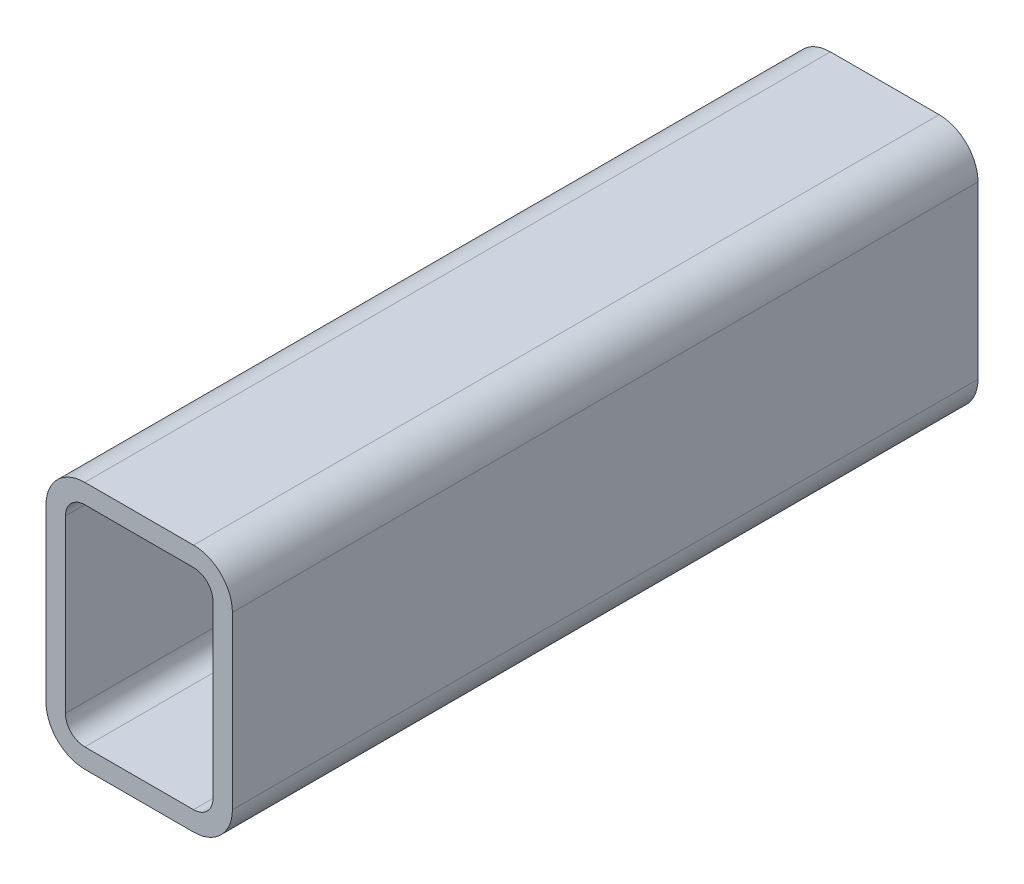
ISO-10303-21;
HEADER;
FILE_DESCRIPTION(('STEP AP214'),'2;1');
FILE_NAME('part.step','',(''),(''),'','','');
FILE_SCHEMA(('AUTOMOTIVE_DESIGN { 1 0 10303 214 1 1 1 1 }'));
ENDSEC;
DATA;
#1=APPLICATION_CONTEXT('core data for automotive mechanical design processes');
#2=APPLICATION_PROTOCOL_DEFINITION('international standard','automotive_design',2000,#1);
#3=PRODUCT_CONTEXT('',#1,'mechanical');
#4=PRODUCT('Part','Part','',(#3));
#5=PRODUCT_RELATED_PRODUCT_CATEGORY('part','',(#4));
#6=PRODUCT_DEFINITION_FORMATION('','',#4);
#7=PRODUCT_DEFINITION_CONTEXT('part definition',#1,'design');
#8=PRODUCT_DEFINITION('design','',#6,#7);
#9=PRODUCT_DEFINITION_SHAPE('','',#8);
#10=(LENGTH_UNIT() NAMED_UNIT(*) SI_UNIT(.MILLI.,.METRE.));
#11=(NAMED_UNIT(*) PLANE_ANGLE_UNIT() SI_UNIT($,.RADIAN.));
#12=(NAMED_UNIT(*) SI_UNIT($,.STERADIAN.) SOLID_ANGLE_UNIT());
#13=UNCERTAINTY_MEASURE_WITH_UNIT(LENGTH_MEASURE(1.E-05),#10,'distance_accuracy_value','');
#14=(GEOMETRIC_REPRESENTATION_CONTEXT(3) GLOBAL_UNCERTAINTY_ASSIGNED_CONTEXT((#13)) GLOBAL_UNIT_ASSIGNED_CONTEXT((#10,
#11,#12)) REPRESENTATION_CONTEXT('',''));
#15=CARTESIAN_POINT('',(0.,0.,0.));
#16=DIRECTION('',(0.,0.,1.));
#17=DIRECTION('',(1.,0.,0.));
#18=AXIS2_PLACEMENT_3D('',#15,#16,#17);
#19=CARTESIAN_POINT('',(18.3641160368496,87.7827651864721,304.8));
#20=DIRECTION('',(0.,0.,1.));
#21=DIRECTION('',(1.,0.,0.));
#22=AXIS2_PLACEMENT_3D('',#19,#20,#21);
#23=PLANE('',#22);
#24=CARTESIAN_POINT('',(18.3641160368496,87.7827651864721,304.8));
#25=DIRECTION('',(0.,0.,1.));
#26=DIRECTION('',(1.,0.,0.));
#27=AXIS2_PLACEMENT_3D('',#24,#25,#26);
#28=CIRCLE('',#27,15.875);
#29=CARTESIAN_POINT('',(18.3641160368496,103.657765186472,304.8));
#30=VERTEX_POINT('',#29);
#31=CARTESIAN_POINT('',(2.48911603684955,87.7827651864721,304.8));
#32=VERTEX_POINT('',#31);
#33=EDGE_CURVE('E213',#30,#32,#28,.T.);
#34=ORIENTED_EDGE('',*,*,#33,.T.);
#35=DIRECTION('',(0.,-1.,0.));
#36=VECTOR('',#35,1.);
#37=CARTESIAN_POINT('',(2.48911603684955,17.9327651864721,304.8));
#38=LINE('',#37,#36);
#39=CARTESIAN_POINT('',(2.48911603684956,17.9327651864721,304.8));
#40=VERTEX_POINT('',#39);
#41=EDGE_CURVE('E216',#32,#40,#38,.T.);
#42=ORIENTED_EDGE('',*,*,#41,.T.);
#43=CARTESIAN_POINT('',(18.3641160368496,17.9327651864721,304.8));
#44=DIRECTION('',(0.,0.,1.));
#45=DIRECTION('',(1.,0.,0.));
#46=AXIS2_PLACEMENT_3D('',#43,#44,#45);
#47=CIRCLE('',#46,15.875);
#48=CARTESIAN_POINT('',(18.3641160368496,2.05776518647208,304.8));
#49=VERTEX_POINT('',#48);
#50=EDGE_CURVE('E219',#40,#49,#47,.T.);
#51=ORIENTED_EDGE('',*,*,#50,.T.);
#52=DIRECTION('',(1.,0.,0.));
#53=VECTOR('',#52,1.);
#54=CARTESIAN_POINT('',(62.8141160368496,2.05776518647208,304.8));
#55=LINE('',#54,#53);
#56=CARTESIAN_POINT('',(62.8141160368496,2.05776518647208,304.8));
#57=VERTEX_POINT('',#56);
#58=EDGE_CURVE('E221',#49,#57,#55,.T.);
#59=ORIENTED_EDGE('',*,*,#58,.T.);
#60=CARTESIAN_POINT('',(62.8141160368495,17.9327651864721,304.8));
#61=DIRECTION('',(0.,0.,1.));
#62=DIRECTION('',(1.,0.,0.));
#63=AXIS2_PLACEMENT_3D('',#60,#61,#62);
#64=CIRCLE('',#63,15.875);
#65=CARTESIAN_POINT('',(78.6891160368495,17.9327651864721,304.8));
#66=VERTEX_POINT('',#65);
#67=EDGE_CURVE('E223',#57,#66,#64,.T.);
#68=ORIENTED_EDGE('',*,*,#67,.T.);
#69=DIRECTION('',(0.,1.,0.));
#70=VECTOR('',#69,1.);
#71=CARTESIAN_POINT('',(78.6891160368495,87.7827651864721,304.8));
#72=LINE('',#71,#70);
#73=CARTESIAN_POINT('',(78.6891160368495,87.7827651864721,304.8));
#74=VERTEX_POINT('',#73);
#75=EDGE_CURVE('E225',#66,#74,#72,.T.);
#76=ORIENTED_EDGE('',*,*,#75,.T.);
#77=CARTESIAN_POINT('',(62.8141160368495,87.7827651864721,304.8));
#78=DIRECTION('',(0.,0.,1.));
#79=DIRECTION('',(1.,0.,0.));
#80=AXIS2_PLACEMENT_3D('',#77,#78,#79);
#81=CIRCLE('',#80,15.875);
#82=CARTESIAN_POINT('',(62.8141160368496,103.657765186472,304.8));
#83=VERTEX_POINT('',#82);
#84=EDGE_CURVE('E227',#74,#83,#81,.T.);
#85=ORIENTED_EDGE('',*,*,#84,.T.);
#86=DIRECTION('',(-1.,0.,0.));
#87=VECTOR('',#86,1.);
#88=CARTESIAN_POINT('',(18.3641160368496,103.657765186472,304.8));
#89=LINE('',#88,#87);
#90=EDGE_CURVE('E229',#83,#30,#89,.T.);
#91=ORIENTED_EDGE('',*,*,#90,.T.);
#92=EDGE_LOOP('',(#34,#42,#51,#59,#68,#76,#85,#91));
#93=FACE_BOUND('',#92,.T.);
#94=DIRECTION('',(0.,-1.,0.));
#95=VECTOR('',#94,1.);
#96=CARTESIAN_POINT('',(10.4266160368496,17.9327651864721,304.8));
#97=LINE('',#96,#95);
#98=CARTESIAN_POINT('',(10.4266160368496,87.7827651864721,304.8));
#99=VERTEX_POINT('',#98);
#100=CARTESIAN_POINT('',(10.4266160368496,17.9327651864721,304.8));
#101=VERTEX_POINT('',#100);
#102=EDGE_CURVE('E156',#99,#101,#97,.T.);
#103=ORIENTED_EDGE('',*,*,#102,.F.);
#104=CARTESIAN_POINT('',(18.3641160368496,87.7827651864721,304.8));
#105=DIRECTION('',(0.,0.,1.));
#106=DIRECTION('',(1.,0.,0.));
#107=AXIS2_PLACEMENT_3D('',#104,#105,#106);
#108=CIRCLE('',#107,7.93750000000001);
#109=CARTESIAN_POINT('',(18.3641160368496,95.7202651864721,304.8));
#110=VERTEX_POINT('',#109);
#111=EDGE_CURVE('E148',#110,#99,#108,.T.);
#112=ORIENTED_EDGE('',*,*,#111,.F.);
#113=DIRECTION('',(-1.,0.,0.));
#114=VECTOR('',#113,1.);
#115=CARTESIAN_POINT('',(18.3641160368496,95.7202651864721,304.8));
#116=LINE('',#115,#114);
#117=CARTESIAN_POINT('',(62.8141160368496,95.7202651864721,304.8));
#118=VERTEX_POINT('',#117);
#119=EDGE_CURVE('E181',#118,#110,#116,.T.);
#120=ORIENTED_EDGE('',*,*,#119,.F.);
#121=CARTESIAN_POINT('',(62.8141160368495,87.7827651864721,304.8));
#122=DIRECTION('',(0.,0.,1.));
#123=DIRECTION('',(1.,0.,0.));
#124=AXIS2_PLACEMENT_3D('',#121,#122,#123);
#125=CIRCLE('',#124,7.9375);
#126=CARTESIAN_POINT('',(70.7516160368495,87.7827651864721,304.8));
#127=VERTEX_POINT('',#126);
#128=EDGE_CURVE('E179',#127,#118,#125,.T.);
#129=ORIENTED_EDGE('',*,*,#128,.F.);
#130=DIRECTION('',(0.,1.,0.));
#131=VECTOR('',#130,1.);
#132=CARTESIAN_POINT('',(70.7516160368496,87.7827651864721,304.8));
#133=LINE('',#132,#131);
#134=CARTESIAN_POINT('',(70.7516160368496,17.9327651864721,304.8));
#135=VERTEX_POINT('',#134);
#136=EDGE_CURVE('E177',#135,#127,#133,.T.);
#137=ORIENTED_EDGE('',*,*,#136,.F.);
#138=CARTESIAN_POINT('',(62.8141160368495,17.9327651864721,304.8));
#139=DIRECTION('',(0.,0.,1.));
#140=DIRECTION('',(1.,0.,0.));
#141=AXIS2_PLACEMENT_3D('',#138,#139,#140);
#142=CIRCLE('',#141,7.9375);
#143=CARTESIAN_POINT('',(62.8141160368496,9.99526518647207,304.8));
#144=VERTEX_POINT('',#143);
#145=EDGE_CURVE('E175',#144,#135,#142,.T.);
#146=ORIENTED_EDGE('',*,*,#145,.F.);
#147=DIRECTION('',(1.,0.,0.));
#148=VECTOR('',#147,1.);
#149=CARTESIAN_POINT('',(62.8141160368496,9.99526518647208,304.8));
#150=LINE('',#149,#148);
#151=CARTESIAN_POINT('',(18.3641160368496,9.99526518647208,304.8));
#152=VERTEX_POINT('',#151);
#153=EDGE_CURVE('E171',#152,#144,#150,.T.);
#154=ORIENTED_EDGE('',*,*,#153,.F.);
#155=CARTESIAN_POINT('',(18.3641160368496,17.9327651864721,304.8));
#156=DIRECTION('',(0.,0.,1.));
#157=DIRECTION('',(1.,0.,0.));
#158=AXIS2_PLACEMENT_3D('',#155,#156,#157);
#159=CIRCLE('',#158,7.9375);
#160=EDGE_CURVE('E169',#101,#152,#159,.T.);
#161=ORIENTED_EDGE('',*,*,#160,.F.);
#162=EDGE_LOOP('',(#103,#112,#120,#129,#137,#146,#154,#161));
#163=FACE_BOUND('',#162,.T.);
#164=ADVANCED_FACE('F35',(#93,#163),#23,.T.);
#165=CARTESIAN_POINT('',(18.3641160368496,87.7827651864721,0.));
#166=DIRECTION('',(0.,0.,1.));
#167=DIRECTION('',(1.,0.,0.));
#168=AXIS2_PLACEMENT_3D('',#165,#166,#167);
#169=PLANE('',#168);
#170=CARTESIAN_POINT('',(18.3641160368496,87.7827651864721,0.));
#171=DIRECTION('',(0.,0.,1.));
#172=DIRECTION('',(1.,0.,0.));
#173=AXIS2_PLACEMENT_3D('',#170,#171,#172);
#174=CIRCLE('',#173,15.875);
#175=CARTESIAN_POINT('',(18.3641160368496,103.657765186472,0.));
#176=VERTEX_POINT('',#175);
#177=CARTESIAN_POINT('',(2.48911603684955,87.7827651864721,0.));
#178=VERTEX_POINT('',#177);
#179=EDGE_CURVE('E164',#176,#178,#174,.T.);
#180=ORIENTED_EDGE('',*,*,#179,.F.);
#181=DIRECTION('',(-1.,0.,0.));
#182=VECTOR('',#181,1.);
#183=CARTESIAN_POINT('',(18.3641160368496,103.657765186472,0.));
#184=LINE('',#183,#182);
#185=CARTESIAN_POINT('',(62.8141160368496,103.657765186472,0.));
#186=VERTEX_POINT('',#185);
#187=EDGE_CURVE('E217',#186,#176,#184,.T.);
#188=ORIENTED_EDGE('',*,*,#187,.F.);
#189=CARTESIAN_POINT('',(62.8141160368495,87.7827651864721,0.));
#190=DIRECTION('',(0.,0.,1.));
#191=DIRECTION('',(1.,0.,0.));
#192=AXIS2_PLACEMENT_3D('',#189,#190,#191);
#193=CIRCLE('',#192,15.875);
#194=CARTESIAN_POINT('',(78.6891160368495,87.7827651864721,0.));
#195=VERTEX_POINT('',#194);
#196=EDGE_CURVE('E244',#195,#186,#193,.T.);
#197=ORIENTED_EDGE('',*,*,#196,.F.);
#198=DIRECTION('',(0.,1.,0.));
#199=VECTOR('',#198,1.);
#200=CARTESIAN_POINT('',(78.6891160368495,87.7827651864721,0.));
#201=LINE('',#200,#199);
#202=CARTESIAN_POINT('',(78.6891160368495,17.9327651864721,0.));
#203=VERTEX_POINT('',#202);
#204=EDGE_CURVE('E242',#203,#195,#201,.T.);
#205=ORIENTED_EDGE('',*,*,#204,.F.);
#206=CARTESIAN_POINT('',(62.8141160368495,17.9327651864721,0.));
#207=DIRECTION('',(0.,0.,1.));
#208=DIRECTION('',(1.,0.,0.));
#209=AXIS2_PLACEMENT_3D('',#206,#207,#208);
#210=CIRCLE('',#209,15.875);
#211=CARTESIAN_POINT('',(62.8141160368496,2.05776518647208,0.));
#212=VERTEX_POINT('',#211);
#213=EDGE_CURVE('E240',#212,#203,#210,.T.);
#214=ORIENTED_EDGE('',*,*,#213,.F.);
#215=DIRECTION('',(1.,0.,0.));
#216=VECTOR('',#215,1.);
#217=CARTESIAN_POINT('',(62.8141160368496,2.05776518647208,0.));
#218=LINE('',#217,#216);
#219=CARTESIAN_POINT('',(18.3641160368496,2.05776518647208,0.));
#220=VERTEX_POINT('',#219);
#221=EDGE_CURVE('E238',#220,#212,#218,.T.);
#222=ORIENTED_EDGE('',*,*,#221,.F.);
#223=CARTESIAN_POINT('',(18.3641160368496,17.9327651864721,0.));
#224=DIRECTION('',(0.,0.,1.));
#225=DIRECTION('',(1.,0.,0.));
#226=AXIS2_PLACEMENT_3D('',#223,#224,#225);
#227=CIRCLE('',#226,15.875);
#228=CARTESIAN_POINT('',(2.48911603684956,17.9327651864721,0.));
#229=VERTEX_POINT('',#228);
#230=EDGE_CURVE('E236',#229,#220,#227,.T.);
#231=ORIENTED_EDGE('',*,*,#230,.F.);
#232=DIRECTION('',(0.,-1.,0.));
#233=VECTOR('',#232,1.);
#234=CARTESIAN_POINT('',(2.48911603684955,17.9327651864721,0.));
#235=LINE('',#234,#233);
#236=EDGE_CURVE('E234',#178,#229,#235,.T.);
#237=ORIENTED_EDGE('',*,*,#236,.F.);
#238=EDGE_LOOP('',(#180,#188,#197,#205,#214,#222,#231,#237));
#239=FACE_BOUND('',#238,.T.);
#240=CARTESIAN_POINT('',(18.3641160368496,87.7827651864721,0.));
#241=DIRECTION('',(0.,0.,1.));
#242=DIRECTION('',(1.,0.,0.));
#243=AXIS2_PLACEMENT_3D('',#240,#241,#242);
#244=CIRCLE('',#243,7.93750000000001);
#245=CARTESIAN_POINT('',(18.3641160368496,95.7202651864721,0.));
#246=VERTEX_POINT('',#245);
#247=CARTESIAN_POINT('',(10.4266160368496,87.7827651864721,0.));
#248=VERTEX_POINT('',#247);
#249=EDGE_CURVE('E58',#246,#248,#244,.T.);
#250=ORIENTED_EDGE('',*,*,#249,.T.);
#251=DIRECTION('',(0.,-1.,0.));
#252=VECTOR('',#251,1.);
#253=CARTESIAN_POINT('',(10.4266160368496,17.9327651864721,0.));
#254=LINE('',#253,#252);
#255=CARTESIAN_POINT('',(10.4266160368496,17.9327651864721,0.));
#256=VERTEX_POINT('',#255);
#257=EDGE_CURVE('E163',#248,#256,#254,.T.);
#258=ORIENTED_EDGE('',*,*,#257,.T.);
#259=CARTESIAN_POINT('',(18.3641160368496,17.9327651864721,0.));
#260=DIRECTION('',(0.,0.,1.));
#261=DIRECTION('',(1.,0.,0.));
#262=AXIS2_PLACEMENT_3D('',#259,#260,#261);
#263=CIRCLE('',#262,7.9375);
#264=CARTESIAN_POINT('',(18.3641160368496,9.99526518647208,0.));
#265=VERTEX_POINT('',#264);
#266=EDGE_CURVE('E185',#256,#265,#263,.T.);
#267=ORIENTED_EDGE('',*,*,#266,.T.);
#268=DIRECTION('',(1.,0.,0.));
#269=VECTOR('',#268,1.);
#270=CARTESIAN_POINT('',(62.8141160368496,9.99526518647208,0.));
#271=LINE('',#270,#269);
#272=CARTESIAN_POINT('',(62.8141160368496,9.99526518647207,0.));
#273=VERTEX_POINT('',#272);
#274=EDGE_CURVE('E188',#265,#273,#271,.T.);
#275=ORIENTED_EDGE('',*,*,#274,.T.);
#276=CARTESIAN_POINT('',(62.8141160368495,17.9327651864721,0.));
#277=DIRECTION('',(0.,0.,1.));
#278=DIRECTION('',(1.,0.,0.));
#279=AXIS2_PLACEMENT_3D('',#276,#277,#278);
#280=CIRCLE('',#279,7.9375);
#281=CARTESIAN_POINT('',(70.7516160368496,17.9327651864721,0.));
#282=VERTEX_POINT('',#281);
#283=EDGE_CURVE('E191',#273,#282,#280,.T.);
#284=ORIENTED_EDGE('',*,*,#283,.T.);
#285=DIRECTION('',(0.,1.,0.));
#286=VECTOR('',#285,1.);
#287=CARTESIAN_POINT('',(70.7516160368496,87.7827651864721,0.));
#288=LINE('',#287,#286);
#289=CARTESIAN_POINT('',(70.7516160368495,87.7827651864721,0.));
#290=VERTEX_POINT('',#289);
#291=EDGE_CURVE('E194',#282,#290,#288,.T.);
#292=ORIENTED_EDGE('',*,*,#291,.T.);
#293=CARTESIAN_POINT('',(62.8141160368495,87.7827651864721,0.));
#294=DIRECTION('',(0.,0.,1.));
#295=DIRECTION('',(1.,0.,0.));
#296=AXIS2_PLACEMENT_3D('',#293,#294,#295);
#297=CIRCLE('',#296,7.9375);
#298=CARTESIAN_POINT('',(62.8141160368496,95.7202651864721,0.));
#299=VERTEX_POINT('',#298);
#300=EDGE_CURVE('E197',#290,#299,#297,.T.);
#301=ORIENTED_EDGE('',*,*,#300,.T.);
#302=DIRECTION('',(-1.,0.,0.));
#303=VECTOR('',#302,1.);
#304=CARTESIAN_POINT('',(18.3641160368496,95.7202651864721,0.));
#305=LINE('',#304,#303);
#306=EDGE_CURVE('E157',#299,#246,#305,.T.);
#307=ORIENTED_EDGE('',*,*,#306,.T.);
#308=EDGE_LOOP('',(#250,#258,#267,#275,#284,#292,#301,#307));
#309=FACE_BOUND('',#308,.T.);
#310=ADVANCED_FACE('F274',(#239,#309),#169,.F.);
#311=CARTESIAN_POINT('',(18.3641160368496,87.7827651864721,304.8));
#312=DIRECTION('',(0.,0.,-1.));
#313=DIRECTION('',(-1.,0.,0.));
#314=AXIS2_PLACEMENT_3D('',#311,#312,#313);
#315=CYLINDRICAL_SURFACE('',#314,15.875);
#316=ORIENTED_EDGE('',*,*,#179,.T.);
#317=DIRECTION('',(0.,0.,-1.));
#318=VECTOR('',#317,1.);
#319=CARTESIAN_POINT('',(2.48911603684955,87.7827651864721,304.8));
#320=LINE('',#319,#318);
#321=EDGE_CURVE('E11',#32,#178,#320,.T.);
#322=ORIENTED_EDGE('',*,*,#321,.F.);
#323=ORIENTED_EDGE('',*,*,#33,.F.);
#324=DIRECTION('',(0.,0.,-1.));
#325=VECTOR('',#324,1.);
#326=CARTESIAN_POINT('',(18.3641160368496,103.657765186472,304.8));
#327=LINE('',#326,#325);
#328=EDGE_CURVE('E231',#30,#176,#327,.T.);
#329=ORIENTED_EDGE('',*,*,#328,.T.);
#330=EDGE_LOOP('',(#316,#322,#323,#329));
#331=FACE_BOUND('',#330,.T.);
#332=ADVANCED_FACE('F37',(#331),#315,.T.);
#333=CARTESIAN_POINT('',(2.48911603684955,17.9327651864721,304.8));
#334=DIRECTION('',(1.,0.,0.));
#335=DIRECTION('',(0.,0.,-1.));
#336=AXIS2_PLACEMENT_3D('',#333,#334,#335);
#337=PLANE('',#336);
#338=ORIENTED_EDGE('',*,*,#236,.T.);
#339=DIRECTION('',(0.,0.,-1.));
#340=VECTOR('',#339,1.);
#341=CARTESIAN_POINT('',(2.48911603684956,17.9327651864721,304.8));
#342=LINE('',#341,#340);
#343=EDGE_CURVE('E43',#40,#229,#342,.T.);
#344=ORIENTED_EDGE('',*,*,#343,.F.);
#345=ORIENTED_EDGE('',*,*,#41,.F.);
#346=ORIENTED_EDGE('',*,*,#321,.T.);
#347=EDGE_LOOP('',(#338,#344,#345,#346));
#348=FACE_BOUND('',#347,.T.);
#349=ADVANCED_FACE('F291',(#348),#337,.F.);
#350=CARTESIAN_POINT('',(18.3641160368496,17.9327651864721,304.8));
#351=DIRECTION('',(0.,0.,-1.));
#352=DIRECTION('',(-1.,0.,0.));
#353=AXIS2_PLACEMENT_3D('',#350,#351,#352);
#354=CYLINDRICAL_SURFACE('',#353,15.875);
#355=ORIENTED_EDGE('',*,*,#230,.T.);
#356=DIRECTION('',(0.,0.,-1.));
#357=VECTOR('',#356,1.);
#358=CARTESIAN_POINT('',(18.3641160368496,2.05776518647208,304.8));
#359=LINE('',#358,#357);
#360=EDGE_CURVE('E261',#49,#220,#359,.T.);
#361=ORIENTED_EDGE('',*,*,#360,.F.);
#362=ORIENTED_EDGE('',*,*,#50,.F.);
#363=ORIENTED_EDGE('',*,*,#343,.T.);
#364=EDGE_LOOP('',(#355,#361,#362,#363));
#365=FACE_BOUND('',#364,.T.);
#366=ADVANCED_FACE('F268',(#365),#354,.T.);
#367=CARTESIAN_POINT('',(62.8141160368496,2.05776518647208,304.8));
#368=DIRECTION('',(0.,1.,0.));
#369=DIRECTION('',(0.,0.,1.));
#370=AXIS2_PLACEMENT_3D('',#367,#368,#369);
#371=PLANE('',#370);
#372=ORIENTED_EDGE('',*,*,#221,.T.);
#373=DIRECTION('',(0.,0.,-1.));
#374=VECTOR('',#373,1.);
#375=CARTESIAN_POINT('',(62.8141160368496,2.05776518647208,304.8));
#376=LINE('',#375,#374);
#377=EDGE_CURVE('E258',#57,#212,#376,.T.);
#378=ORIENTED_EDGE('',*,*,#377,.F.);
#379=ORIENTED_EDGE('',*,*,#58,.F.);
#380=ORIENTED_EDGE('',*,*,#360,.T.);
#381=EDGE_LOOP('',(#372,#378,#379,#380));
#382=FACE_BOUND('',#381,.T.);
#383=ADVANCED_FACE('F280',(#382),#371,.F.);
#384=CARTESIAN_POINT('',(62.8141160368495,17.9327651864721,304.8));
#385=DIRECTION('',(0.,0.,-1.));
#386=DIRECTION('',(-1.,0.,0.));
#387=AXIS2_PLACEMENT_3D('',#384,#385,#386);
#388=CYLINDRICAL_SURFACE('',#387,15.875);
#389=ORIENTED_EDGE('',*,*,#213,.T.);
#390=DIRECTION('',(0.,0.,-1.));
#391=VECTOR('',#390,1.);
#392=CARTESIAN_POINT('',(78.6891160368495,17.9327651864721,304.8));
#393=LINE('',#392,#391);
#394=EDGE_CURVE('E255',#66,#203,#393,.T.);
#395=ORIENTED_EDGE('',*,*,#394,.F.);
#396=ORIENTED_EDGE('',*,*,#67,.F.);
#397=ORIENTED_EDGE('',*,*,#377,.T.);
#398=EDGE_LOOP('',(#389,#395,#396,#397));
#399=FACE_BOUND('',#398,.T.);
#400=ADVANCED_FACE('F284',(#399),#388,.T.);
#401=CARTESIAN_POINT('',(78.6891160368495,87.7827651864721,304.8));
#402=DIRECTION('',(-1.,0.,0.));
#403=DIRECTION('',(0.,0.,1.));
#404=AXIS2_PLACEMENT_3D('',#401,#402,#403);
#405=PLANE('',#404);
#406=ORIENTED_EDGE('',*,*,#204,.T.);
#407=DIRECTION('',(0.,0.,-1.));
#408=VECTOR('',#407,1.);
#409=CARTESIAN_POINT('',(78.6891160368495,87.7827651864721,304.8));
#410=LINE('',#409,#408);
#411=EDGE_CURVE('E252',#74,#195,#410,.T.);
#412=ORIENTED_EDGE('',*,*,#411,.F.);
#413=ORIENTED_EDGE('',*,*,#75,.F.);
#414=ORIENTED_EDGE('',*,*,#394,.T.);
#415=EDGE_LOOP('',(#406,#412,#413,#414));
#416=FACE_BOUND('',#415,.T.);
#417=ADVANCED_FACE('F304',(#416),#405,.F.);
#418=CARTESIAN_POINT('',(62.8141160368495,87.7827651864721,304.8));
#419=DIRECTION('',(0.,0.,-1.));
#420=DIRECTION('',(-1.,0.,0.));
#421=AXIS2_PLACEMENT_3D('',#418,#419,#420);
#422=CYLINDRICAL_SURFACE('',#421,15.875);
#423=ORIENTED_EDGE('',*,*,#196,.T.);
#424=DIRECTION('',(0.,0.,-1.));
#425=VECTOR('',#424,1.);
#426=CARTESIAN_POINT('',(62.8141160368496,103.657765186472,304.8));
#427=LINE('',#426,#425);
#428=EDGE_CURVE('E249',#83,#186,#427,.T.);
#429=ORIENTED_EDGE('',*,*,#428,.F.);
#430=ORIENTED_EDGE('',*,*,#84,.F.);
#431=ORIENTED_EDGE('',*,*,#411,.T.);
#432=EDGE_LOOP('',(#423,#429,#430,#431));
#433=FACE_BOUND('',#432,.T.);
#434=ADVANCED_FACE('F302',(#433),#422,.T.);
#435=CARTESIAN_POINT('',(18.3641160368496,103.657765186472,304.8));
#436=DIRECTION('',(0.,-1.,0.));
#437=DIRECTION('',(0.,0.,-1.));
#438=AXIS2_PLACEMENT_3D('',#435,#436,#437);
#439=PLANE('',#438);
#440=ORIENTED_EDGE('',*,*,#187,.T.);
#441=ORIENTED_EDGE('',*,*,#328,.F.);
#442=ORIENTED_EDGE('',*,*,#90,.F.);
#443=ORIENTED_EDGE('',*,*,#428,.T.);
#444=EDGE_LOOP('',(#440,#441,#442,#443));
#445=FACE_BOUND('',#444,.T.);
#446=ADVANCED_FACE('F297',(#445),#439,.F.);
#447=CARTESIAN_POINT('',(18.3641160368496,87.7827651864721,304.8));
#448=DIRECTION('',(0.,0.,-1.));
#449=DIRECTION('',(-1.,0.,0.));
#450=AXIS2_PLACEMENT_3D('',#447,#448,#449);
#451=CYLINDRICAL_SURFACE('',#450,7.93750000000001);
#452=ORIENTED_EDGE('',*,*,#249,.F.);
#453=DIRECTION('',(0.,0.,-1.));
#454=VECTOR('',#453,1.);
#455=CARTESIAN_POINT('',(18.3641160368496,95.7202651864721,304.8));
#456=LINE('',#455,#454);
#457=EDGE_CURVE('E152',#110,#246,#456,.T.);
#458=ORIENTED_EDGE('',*,*,#457,.F.);
#459=ORIENTED_EDGE('',*,*,#111,.T.);
#460=DIRECTION('',(0.,0.,-1.));
#461=VECTOR('',#460,1.);
#462=CARTESIAN_POINT('',(10.4266160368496,87.7827651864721,304.8));
#463=LINE('',#462,#461);
#464=EDGE_CURVE('E151',#99,#248,#463,.T.);
#465=ORIENTED_EDGE('',*,*,#464,.T.);
#466=EDGE_LOOP('',(#452,#458,#459,#465));
#467=FACE_BOUND('',#466,.T.);
#468=ADVANCED_FACE('F150',(#467),#451,.F.);
#469=CARTESIAN_POINT('',(10.4266160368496,17.9327651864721,304.8));
#470=DIRECTION('',(1.,0.,0.));
#471=DIRECTION('',(0.,0.,-1.));
#472=AXIS2_PLACEMENT_3D('',#469,#470,#471);
#473=PLANE('',#472);
#474=ORIENTED_EDGE('',*,*,#257,.F.);
#475=ORIENTED_EDGE('',*,*,#464,.F.);
#476=ORIENTED_EDGE('',*,*,#102,.T.);
#477=DIRECTION('',(0.,0.,-1.));
#478=VECTOR('',#477,1.);
#479=CARTESIAN_POINT('',(10.4266160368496,17.9327651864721,304.8));
#480=LINE('',#479,#478);
#481=EDGE_CURVE('E165',#101,#256,#480,.T.);
#482=ORIENTED_EDGE('',*,*,#481,.T.);
#483=EDGE_LOOP('',(#474,#475,#476,#482));
#484=FACE_BOUND('',#483,.T.);
#485=ADVANCED_FACE('F160',(#484),#473,.T.);
#486=CARTESIAN_POINT('',(18.3641160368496,17.9327651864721,304.8));
#487=DIRECTION('',(0.,0.,-1.));
#488=DIRECTION('',(-1.,0.,0.));
#489=AXIS2_PLACEMENT_3D('',#486,#487,#488);
#490=CYLINDRICAL_SURFACE('',#489,7.9375);
#491=ORIENTED_EDGE('',*,*,#266,.F.);
#492=ORIENTED_EDGE('',*,*,#481,.F.);
#493=ORIENTED_EDGE('',*,*,#160,.T.);
#494=DIRECTION('',(0.,0.,-1.));
#495=VECTOR('',#494,1.);
#496=CARTESIAN_POINT('',(18.3641160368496,9.99526518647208,304.8));
#497=LINE('',#496,#495);
#498=EDGE_CURVE('E210',#152,#265,#497,.T.);
#499=ORIENTED_EDGE('',*,*,#498,.T.);
#500=EDGE_LOOP('',(#491,#492,#493,#499));
#501=FACE_BOUND('',#500,.T.);
#502=ADVANCED_FACE('F329',(#501),#490,.F.);
#503=CARTESIAN_POINT('',(62.8141160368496,9.99526518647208,304.8));
#504=DIRECTION('',(0.,1.,0.));
#505=DIRECTION('',(0.,0.,1.));
#506=AXIS2_PLACEMENT_3D('',#503,#504,#505);
#507=PLANE('',#506);
#508=ORIENTED_EDGE('',*,*,#274,.F.);
#509=ORIENTED_EDGE('',*,*,#498,.F.);
#510=ORIENTED_EDGE('',*,*,#153,.T.);
#511=DIRECTION('',(0.,0.,-1.));
#512=VECTOR('',#511,1.);
#513=CARTESIAN_POINT('',(62.8141160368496,9.99526518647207,304.8));
#514=LINE('',#513,#512);
#515=EDGE_CURVE('E208',#144,#273,#514,.T.);
#516=ORIENTED_EDGE('',*,*,#515,.T.);
#517=EDGE_LOOP('',(#508,#509,#510,#516));
#518=FACE_BOUND('',#517,.T.);
#519=ADVANCED_FACE('F333',(#518),#507,.T.);
#520=CARTESIAN_POINT('',(62.8141160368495,17.9327651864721,304.8));
#521=DIRECTION('',(0.,0.,-1.));
#522=DIRECTION('',(-1.,0.,0.));
#523=AXIS2_PLACEMENT_3D('',#520,#521,#522);
#524=CYLINDRICAL_SURFACE('',#523,7.9375);
#525=ORIENTED_EDGE('',*,*,#283,.F.);
#526=ORIENTED_EDGE('',*,*,#515,.F.);
#527=ORIENTED_EDGE('',*,*,#145,.T.);
#528=DIRECTION('',(0.,0.,-1.));
#529=VECTOR('',#528,1.);
#530=CARTESIAN_POINT('',(70.7516160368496,17.9327651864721,304.8));
#531=LINE('',#530,#529);
#532=EDGE_CURVE('E206',#135,#282,#531,.T.);
#533=ORIENTED_EDGE('',*,*,#532,.T.);
#534=EDGE_LOOP('',(#525,#526,#527,#533));
#535=FACE_BOUND('',#534,.T.);
#536=ADVANCED_FACE('F339',(#535),#524,.F.);
#537=CARTESIAN_POINT('',(70.7516160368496,87.7827651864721,304.8));
#538=DIRECTION('',(-1.,0.,0.));
#539=DIRECTION('',(0.,0.,1.));
#540=AXIS2_PLACEMENT_3D('',#537,#538,#539);
#541=PLANE('',#540);
#542=ORIENTED_EDGE('',*,*,#291,.F.);
#543=ORIENTED_EDGE('',*,*,#532,.F.);
#544=ORIENTED_EDGE('',*,*,#136,.T.);
#545=DIRECTION('',(0.,0.,-1.));
#546=VECTOR('',#545,1.);
#547=CARTESIAN_POINT('',(70.7516160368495,87.7827651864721,304.8));
#548=LINE('',#547,#546);
#549=EDGE_CURVE('E204',#127,#290,#548,.T.);
#550=ORIENTED_EDGE('',*,*,#549,.T.);
#551=EDGE_LOOP('',(#542,#543,#544,#550));
#552=FACE_BOUND('',#551,.T.);
#553=ADVANCED_FACE('F343',(#552),#541,.T.);
#554=CARTESIAN_POINT('',(62.8141160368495,87.7827651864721,304.8));
#555=DIRECTION('',(0.,0.,-1.));
#556=DIRECTION('',(-1.,0.,0.));
#557=AXIS2_PLACEMENT_3D('',#554,#555,#556);
#558=CYLINDRICAL_SURFACE('',#557,7.9375);
#559=ORIENTED_EDGE('',*,*,#300,.F.);
#560=ORIENTED_EDGE('',*,*,#549,.F.);
#561=ORIENTED_EDGE('',*,*,#128,.T.);
#562=DIRECTION('',(0.,0.,-1.));
#563=VECTOR('',#562,1.);
#564=CARTESIAN_POINT('',(62.8141160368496,95.7202651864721,304.8));
#565=LINE('',#564,#563);
#566=EDGE_CURVE('E50',#118,#299,#565,.T.);
#567=ORIENTED_EDGE('',*,*,#566,.T.);
#568=EDGE_LOOP('',(#559,#560,#561,#567));
#569=FACE_BOUND('',#568,.T.);
#570=ADVANCED_FACE('F347',(#569),#558,.F.);
#571=CARTESIAN_POINT('',(18.3641160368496,95.7202651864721,304.8));
#572=DIRECTION('',(0.,-1.,0.));
#573=DIRECTION('',(0.,0.,-1.));
#574=AXIS2_PLACEMENT_3D('',#571,#572,#573);
#575=PLANE('',#574);
#576=ORIENTED_EDGE('',*,*,#306,.F.);
#577=ORIENTED_EDGE('',*,*,#566,.F.);
#578=ORIENTED_EDGE('',*,*,#119,.T.);
#579=ORIENTED_EDGE('',*,*,#457,.T.);
#580=EDGE_LOOP('',(#576,#577,#578,#579));
#581=FACE_BOUND('',#580,.T.);
#582=ADVANCED_FACE('F351',(#581),#575,.T.);
#583=CLOSED_SHELL('',(#164,#310,#332,#349,#366,#383,#400,#417,#434,#446,#468,#485,#502,#519,
#536,#553,#570,#582));
#584=MANIFOLD_SOLID_BREP('B2',#583);
#585=ADVANCED_BREP_SHAPE_REPRESENTATION('',(#18,#584),#14);
#586=SHAPE_DEFINITION_REPRESENTATION(#9,#585);
ENDSEC;
END-ISO-10303-21;
